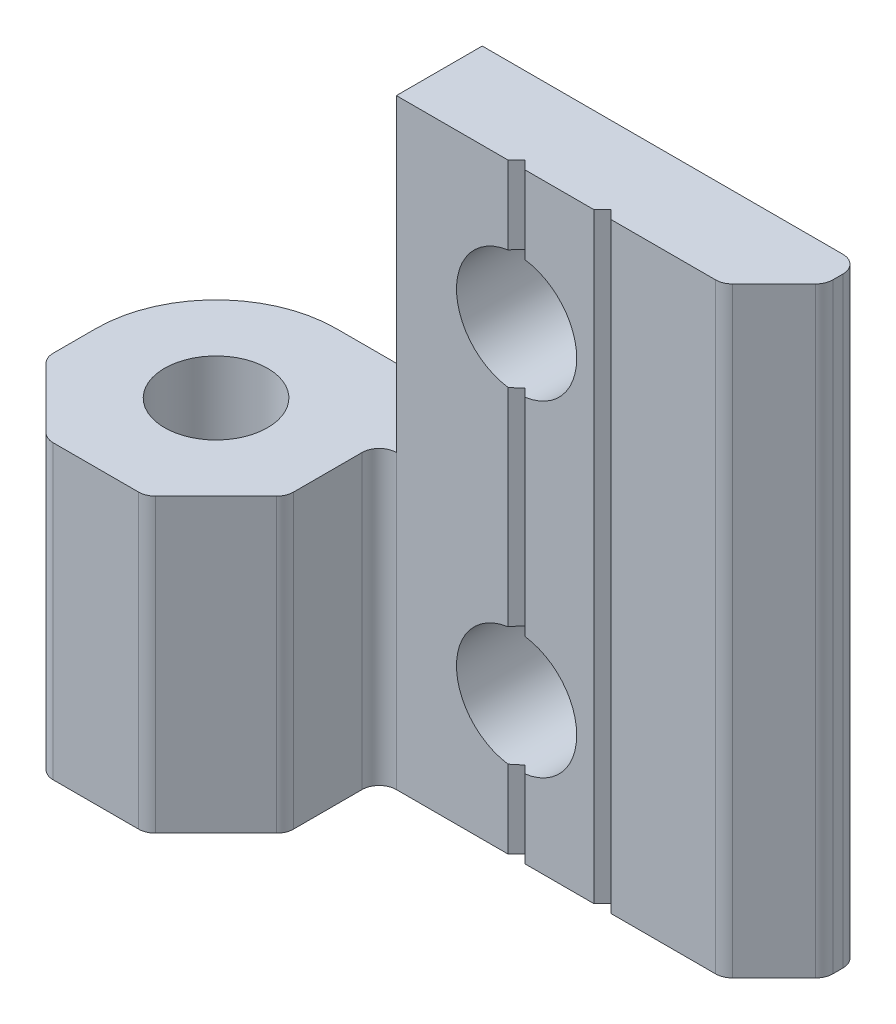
from build123d import *

# Parameters (mm, degrees)
SKETCH_1_R                = 3
EXTRUDE_1_DEPTH           = 35
SKETCH_2_W                = 32.756431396
SKETCH_2_H                = 26.667932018
CUT_EXTRUDE_1_DEPTH       = 35
HOLE_WIZARD_7_0_7_1_D     = 7
HOLE_WIZARD_7_0_7_1_DEPTH = 30
HOLE_WIZARD_7_0_7_1_TIP   = 2.103012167


with BuildPart() as part:
    # Sketch 1 → Extrude 1 (new body)
    with BuildSketch(Plane(origin=(0, 0, 0), x_dir=(1, 0, 0), z_dir=(0, 1, 0))):
        with BuildLine():
            Line((30, 5.914213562), (30, 6.5))
            ThreePointArc((30, 6.5), (29.707106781, 7.207106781), (29, 7.5))
            Line((29, 7.5), (5.5, 7.5))
            ThreePointArc((5.5, 7.5), (5.25, 7.433012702), (5.066987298, 7.25))
            ThreePointArc((5.066987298, 7.25), (4.883974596, 7.066987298), (4.633974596, 7))
            Line((4.633974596, 7), (0, 7))
            ThreePointArc((0, 7), (-4.949747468, 4.949747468), (-7, 0))
            Line((-7, 0), (-7, -2.485281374))
            ThreePointArc((-7, -2.485281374), (-6.923879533, -2.867964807), (-6.707106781, -3.192388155))
            Line((-6.707106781, -3.192388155), (-3.192388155, -6.707106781))
            ThreePointArc((-3.192388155, -6.707106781), (-2.867964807, -6.923879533), (-2.485281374, -7))
            Line((-2.485281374, -7), (2.485281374, -7))
            ThreePointArc((2.485281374, -7), (2.867964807, -6.923879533), (3.192388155, -6.707106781))
            Line((3.192388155, -6.707106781), (6.707106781, -3.192388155))
            ThreePointArc((6.707106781, -3.192388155), (6.923879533, -2.867964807), (7, -2.485281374))
            Line((7, -2.485281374), (7, 1.5))
            ThreePointArc((7, 1.5), (7.292893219, 2.207106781), (8, 2.5))
            Line((8, 2.5), (14.5, 2.5))
            Line((14.5, 2.5), (15, 3))
            Line((15, 3), (15.5, 2.5))
            Line((15.5, 2.5), (19.5, 2.5))
            Line((19.5, 2.5), (20, 3))
            Line((20, 3), (20.5, 2.5))
            Line((20.5, 2.5), (26.585786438, 2.5))
            ThreePointArc((26.585786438, 2.5), (26.96846987, 2.576120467), (27.292893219, 2.792893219))
            Line((27.292893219, 2.792893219), (29.707106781, 5.207106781))
            ThreePointArc((29.707106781, 5.207106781), (29.923879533, 5.53153013), (30, 5.914213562))
        make_face()
        with Locations(Location((0, 0, 0), (0, 0, 270))):
            Circle(SKETCH_1_R, mode=Mode.SUBTRACT)
    extrude(amount=EXTRUDE_1_DEPTH)

    # Sketch 2 → Cut-Extrude 1 (cut)
    with BuildSketch(Plane(origin=(0, 0, -7.5), x_dir=(-1, 0, 0), z_dir=(0, 0, -1))):
        with Locations((8.378215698, 30.333966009)):
            Rectangle(SKETCH_2_W, SKETCH_2_H)
    extrude(amount=-CUT_EXTRUDE_1_DEPTH, mode=Mode.SUBTRACT)

    # Hole Wizard 7.0 _7_ _1
    with Locations(Plane(origin=(15, 27, -2.5), x_dir=(1, 0, 0), z_dir=(0, 0, 1))):
        with Locations((0, 0), (0, -19)):
            Hole(HOLE_WIZARD_7_0_7_1_D / 2, depth=HOLE_WIZARD_7_0_7_1_DEPTH)
            with Locations((0, 0, -(HOLE_WIZARD_7_0_7_1_DEPTH + HOLE_WIZARD_7_0_7_1_TIP / 2))):  # 118° drill point
                Cone(0, HOLE_WIZARD_7_0_7_1_D / 2, HOLE_WIZARD_7_0_7_1_TIP, mode=Mode.SUBTRACT)


solid = part.part
